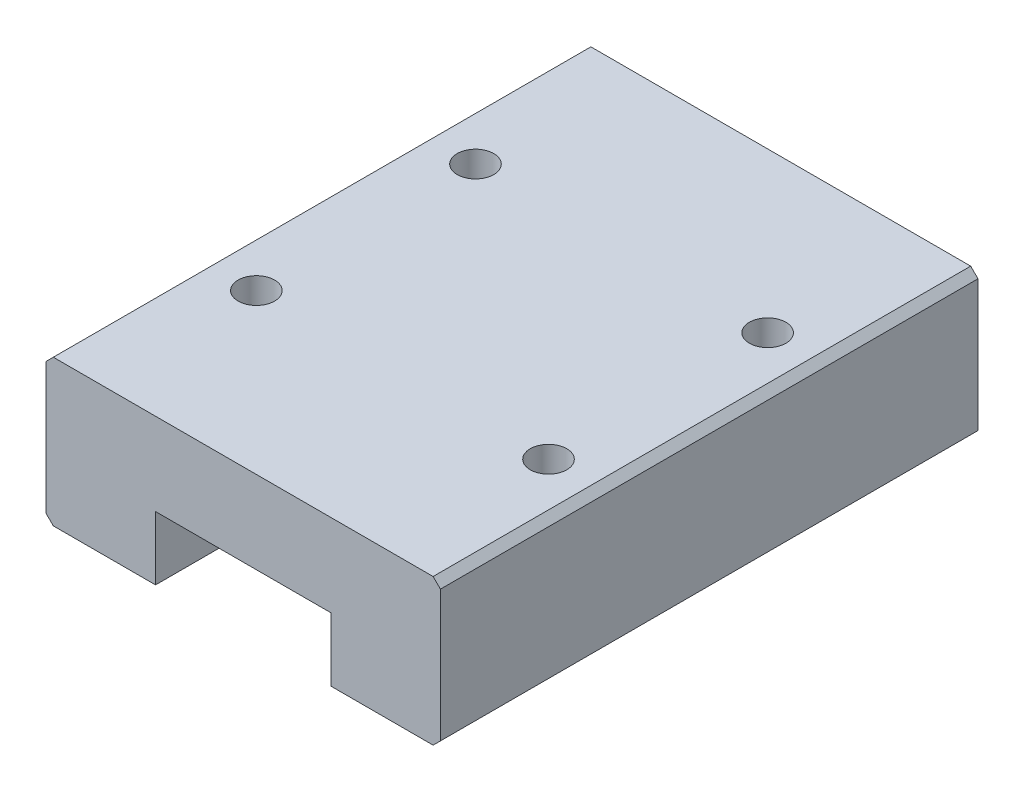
from build123d import *

# Parameters (mm, degrees)
EXTRUDE_1_DEPTH     = 36.8
SKETCH_2_R          = 1.25
CUT_EXTRUDE_1_DEPTH = 36.8


with BuildPart() as part:
    # Sketch 1 → Extrude 1 (new body)
    with BuildSketch(Plane.XY):
        Polygon((27, 0.5), (26.5, 0), (19.5, 0), (19.5, 4.35), (7.5, 4.35), (7.5, 0), (0.5, 0), (0, 0.5), (0, 9.5), (0.5, 10), (26.5, 10), (27, 9.5), align=None)
    extrude(amount=EXTRUDE_1_DEPTH)

    # Sketch 2 → Cut-Extrude 1 (cut)
    with BuildSketch(Plane(origin=(0, 10, 0), x_dir=(1, 0, 0), z_dir=(0, 1, 0))):
        with Locations(Location((3.5, -25.9, 0), (0, 0, 270))):
            Circle(SKETCH_2_R)
        with Locations(Location((23.5, -25.9, 0), (0, 0, 270))):
            Circle(SKETCH_2_R)
        with Locations(Location((23.5, -10.9, 0), (0, 0, 270))):
            Circle(SKETCH_2_R)
        with Locations(Location((3.5, -10.9, 0), (0, 0, 270))):
            Circle(SKETCH_2_R)
    extrude(amount=-CUT_EXTRUDE_1_DEPTH, mode=Mode.SUBTRACT)


solid = part.part
